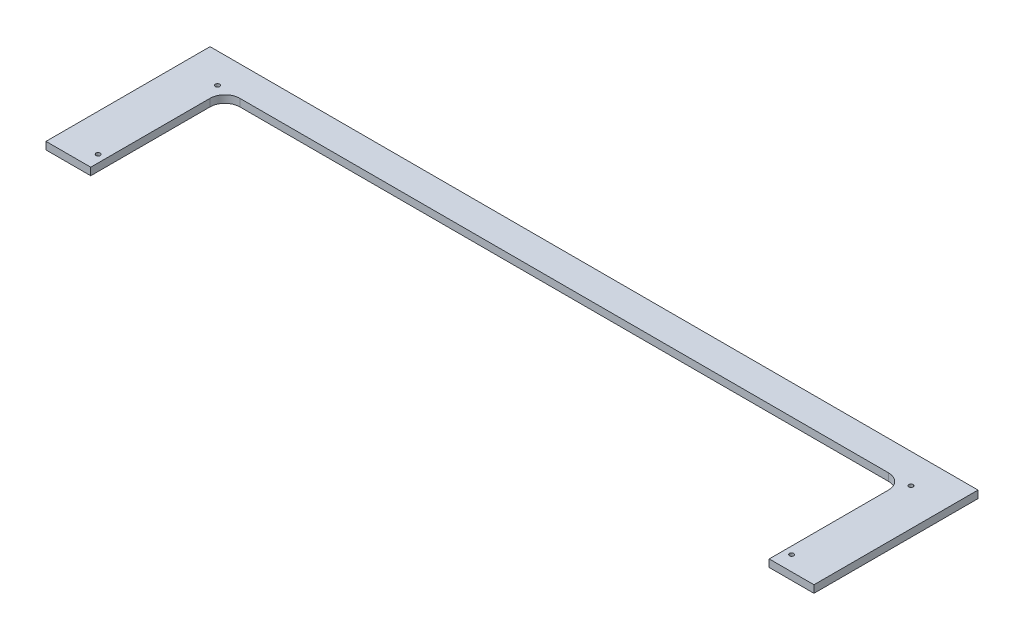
from build123d import *

# Parameters (mm, degrees)
SKETCH1_W                                         = 654.05
SKETCH1_H                                         = 139.7
BOSS_EXTRUDE1_DEPTH                               = 6.35
CUT_EXTRUDE1_DEPTH                                = 335.461799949
CSK_FOR_6_FLAT_HEAD_SOCKET_CAP_SCREW1_D           = 3.6576
CSK_FOR_6_FLAT_HEAD_SOCKET_CAP_SCREW1_CSINK_D     = 7.7978
CSK_FOR_6_FLAT_HEAD_SOCKET_CAP_SCREW1_CSINK_ANGLE = 82
F_6_32_TAPPED_HOLE1_D                             = 2.7051
F_6_32_TAPPED_HOLE1_DEPTH                         = 10.9728
F_6_32_TAPPED_HOLE1_TIP                           = 0.81269403


with BuildPart() as part:
    # Sketch1 → Boss-Extrude1 (new body)
    with BuildSketch(Plane(origin=(0, 0, 0), x_dir=(1, 0, 0), z_dir=(0, 1, 0))):
        Rectangle(SKETCH1_W, SKETCH1_H)
    extrude(amount=BOSS_EXTRUDE1_DEPTH)

    # Sketch2 → Cut-Extrude1 (cut, through all)
    with BuildSketch(Plane(origin=(0, 6.35, 0), x_dir=(1, 0, 0), z_dir=(0, 1, 0))):
        with BuildLine():
            Line((-288.925, -69.85), (-288.925, 31.75))
            ThreePointArc((-288.925, 31.75), (-285.205256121, 40.730256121), (-276.225, 44.45))
            Line((-276.225, 44.45), (276.225, 44.45))
            ThreePointArc((276.225, 44.45), (285.205256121, 40.730256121), (288.925, 31.75))
            Line((288.925, 31.75), (288.925, -69.85))
            Line((288.925, -69.85), (-288.925, -69.85))
        make_face()
    extrude(amount=-CUT_EXTRUDE1_DEPTH, mode=Mode.SUBTRACT)

    # CSK for _6 Flat Head Socket Cap Screw1 (through all)
    with Locations(Plane(origin=(0, 0, 0), x_dir=(-1, 0, 0), z_dir=(0, -1, 0))):
        with Locations((295.275, -57.15), (295.275, 44.45), (-295.275, 44.45), (-295.275, -57.15)):
            CounterSinkHole(CSK_FOR_6_FLAT_HEAD_SOCKET_CAP_SCREW1_D / 2, CSK_FOR_6_FLAT_HEAD_SOCKET_CAP_SCREW1_CSINK_D / 2, counter_sink_angle=CSK_FOR_6_FLAT_HEAD_SOCKET_CAP_SCREW1_CSINK_ANGLE)

    # 6-32 Tapped Hole1
    with Locations(Plane(origin=(0, 0, -69.85), x_dir=(-1, 0, 0), z_dir=(0, 0, -1))):
        with Locations((-295.275, 3.175), (-98.425, 3.175), (98.425, 3.175), (295.275, 3.175)):
            Hole(F_6_32_TAPPED_HOLE1_D / 2, depth=F_6_32_TAPPED_HOLE1_DEPTH)
            with Locations((0, 0, -(F_6_32_TAPPED_HOLE1_DEPTH + F_6_32_TAPPED_HOLE1_TIP / 2))):  # 118° drill point
                Cone(0, F_6_32_TAPPED_HOLE1_D / 2, F_6_32_TAPPED_HOLE1_TIP, mode=Mode.SUBTRACT)


solid = part.part
